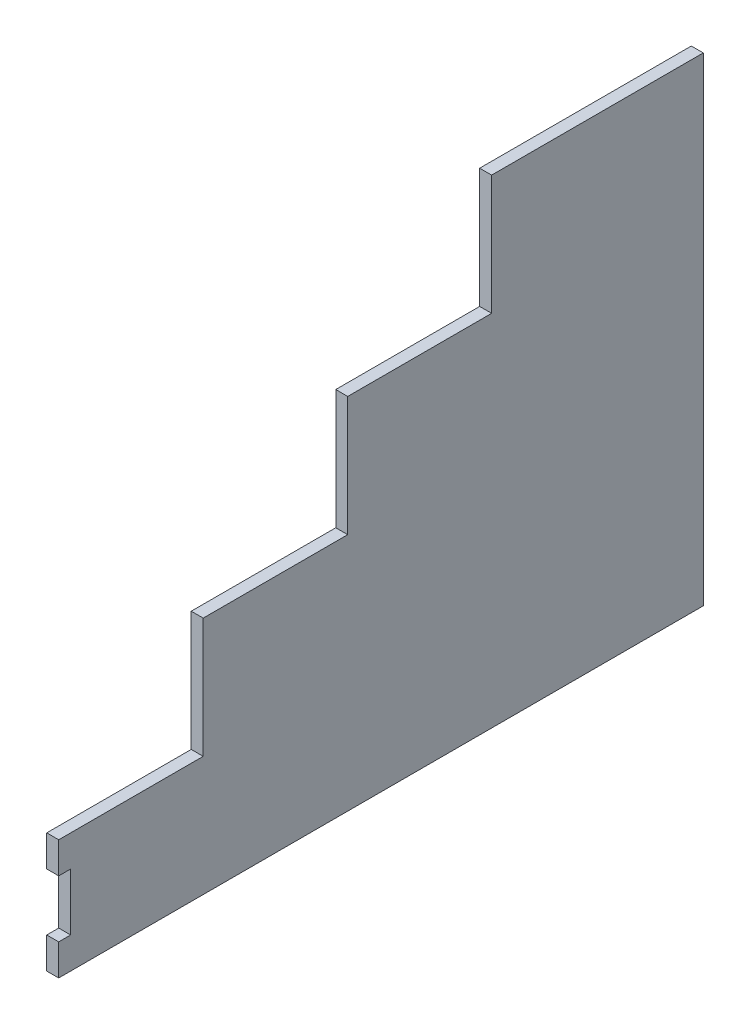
ISO-10303-21;
HEADER;
FILE_DESCRIPTION(('STEP AP214'),'2;1');
FILE_NAME('part.step','',(''),(''),'','','');
FILE_SCHEMA(('AUTOMOTIVE_DESIGN { 1 0 10303 214 1 1 1 1 }'));
ENDSEC;
DATA;
#1=APPLICATION_CONTEXT('core data for automotive mechanical design processes');
#2=APPLICATION_PROTOCOL_DEFINITION('international standard','automotive_design',2000,#1);
#3=PRODUCT_CONTEXT('',#1,'mechanical');
#4=PRODUCT('Part','Part','',(#3));
#5=PRODUCT_RELATED_PRODUCT_CATEGORY('part','',(#4));
#6=PRODUCT_DEFINITION_FORMATION('','',#4);
#7=PRODUCT_DEFINITION_CONTEXT('part definition',#1,'design');
#8=PRODUCT_DEFINITION('design','',#6,#7);
#9=PRODUCT_DEFINITION_SHAPE('','',#8);
#10=(LENGTH_UNIT() NAMED_UNIT(*) SI_UNIT(.MILLI.,.METRE.));
#11=(NAMED_UNIT(*) PLANE_ANGLE_UNIT() SI_UNIT($,.RADIAN.));
#12=(NAMED_UNIT(*) SI_UNIT($,.STERADIAN.) SOLID_ANGLE_UNIT());
#13=UNCERTAINTY_MEASURE_WITH_UNIT(LENGTH_MEASURE(1.E-05),#10,'distance_accuracy_value','');
#14=(GEOMETRIC_REPRESENTATION_CONTEXT(3) GLOBAL_UNCERTAINTY_ASSIGNED_CONTEXT((#13)) GLOBAL_UNIT_ASSIGNED_CONTEXT((#10,
#11,#12)) REPRESENTATION_CONTEXT('',''));
#15=CARTESIAN_POINT('',(0.,0.,0.));
#16=DIRECTION('',(0.,0.,1.));
#17=DIRECTION('',(1.,0.,0.));
#18=AXIS2_PLACEMENT_3D('',#15,#16,#17);
#19=CARTESIAN_POINT('',(6.35,0.,101.6));
#20=DIRECTION('',(0.,1.,0.));
#21=DIRECTION('',(0.,0.,1.));
#22=AXIS2_PLACEMENT_3D('',#19,#20,#21);
#23=PLANE('',#22);
#24=DIRECTION('',(0.,0.,-1.));
#25=VECTOR('',#24,1.);
#26=CARTESIAN_POINT('',(-6.35,0.,101.6));
#27=LINE('',#26,#25);
#28=CARTESIAN_POINT('',(-6.35,0.,785.375879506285));
#29=VERTEX_POINT('',#28);
#30=CARTESIAN_POINT('',(-6.35,0.,101.6));
#31=VERTEX_POINT('',#30);
#32=EDGE_CURVE('E162',#29,#31,#27,.T.);
#33=ORIENTED_EDGE('',*,*,#32,.T.);
#34=DIRECTION('',(-1.,0.,0.));
#35=VECTOR('',#34,1.);
#36=CARTESIAN_POINT('',(6.35,0.,101.6));
#37=LINE('',#36,#35);
#38=CARTESIAN_POINT('',(6.35,0.,101.6));
#39=VERTEX_POINT('',#38);
#40=EDGE_CURVE('E11',#39,#31,#37,.T.);
#41=ORIENTED_EDGE('',*,*,#40,.F.);
#42=DIRECTION('',(0.,0.,-1.));
#43=VECTOR('',#42,1.);
#44=CARTESIAN_POINT('',(6.35,0.,101.6));
#45=LINE('',#44,#43);
#46=CARTESIAN_POINT('',(6.35,0.,785.375879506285));
#47=VERTEX_POINT('',#46);
#48=EDGE_CURVE('E188',#47,#39,#45,.T.);
#49=ORIENTED_EDGE('',*,*,#48,.F.);
#50=DIRECTION('',(-1.,0.,0.));
#51=VECTOR('',#50,1.);
#52=CARTESIAN_POINT('',(6.35,0.,785.375879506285));
#53=LINE('',#52,#51);
#54=EDGE_CURVE('E158',#47,#29,#53,.T.);
#55=ORIENTED_EDGE('',*,*,#54,.T.);
#56=EDGE_LOOP('',(#33,#41,#49,#55));
#57=FACE_BOUND('',#56,.T.);
#58=ADVANCED_FACE('F30',(#57),#23,.F.);
#59=CARTESIAN_POINT('',(6.35,0.,101.6));
#60=DIRECTION('',(0.,0.,1.));
#61=DIRECTION('',(1.,0.,0.));
#62=AXIS2_PLACEMENT_3D('',#59,#60,#61);
#63=PLANE('',#62);
#64=DIRECTION('',(0.,1.,0.));
#65=VECTOR('',#64,1.);
#66=CARTESIAN_POINT('',(-6.35,0.,101.6));
#67=LINE('',#66,#65);
#68=CARTESIAN_POINT('',(-6.35,508.,101.6));
#69=VERTEX_POINT('',#68);
#70=EDGE_CURVE('E165',#31,#69,#67,.T.);
#71=ORIENTED_EDGE('',*,*,#70,.T.);
#72=DIRECTION('',(-1.,0.,0.));
#73=VECTOR('',#72,1.);
#74=CARTESIAN_POINT('',(6.35,508.,101.6));
#75=LINE('',#74,#73);
#76=CARTESIAN_POINT('',(6.35,508.,101.6));
#77=VERTEX_POINT('',#76);
#78=EDGE_CURVE('E38',#77,#69,#75,.T.);
#79=ORIENTED_EDGE('',*,*,#78,.F.);
#80=DIRECTION('',(0.,1.,0.));
#81=VECTOR('',#80,1.);
#82=CARTESIAN_POINT('',(6.35,0.,101.6));
#83=LINE('',#82,#81);
#84=EDGE_CURVE('E107',#39,#77,#83,.T.);
#85=ORIENTED_EDGE('',*,*,#84,.F.);
#86=ORIENTED_EDGE('',*,*,#40,.T.);
#87=EDGE_LOOP('',(#71,#79,#85,#86));
#88=FACE_BOUND('',#87,.T.);
#89=ADVANCED_FACE('F276',(#88),#63,.F.);
#90=CARTESIAN_POINT('',(6.35,508.,101.6));
#91=DIRECTION('',(0.,-1.,0.));
#92=DIRECTION('',(0.,0.,-1.));
#93=AXIS2_PLACEMENT_3D('',#90,#91,#92);
#94=PLANE('',#93);
#95=DIRECTION('',(0.,0.,1.));
#96=VECTOR('',#95,1.);
#97=CARTESIAN_POINT('',(-6.35,508.,101.6));
#98=LINE('',#97,#96);
#99=CARTESIAN_POINT('',(-6.35,508.,326.106403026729));
#100=VERTEX_POINT('',#99);
#101=EDGE_CURVE('E167',#69,#100,#98,.T.);
#102=ORIENTED_EDGE('',*,*,#101,.T.);
#103=DIRECTION('',(-1.,0.,0.));
#104=VECTOR('',#103,1.);
#105=CARTESIAN_POINT('',(6.35,508.,326.106403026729));
#106=LINE('',#105,#104);
#107=CARTESIAN_POINT('',(6.35,508.,326.106403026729));
#108=VERTEX_POINT('',#107);
#109=EDGE_CURVE('E213',#108,#100,#106,.T.);
#110=ORIENTED_EDGE('',*,*,#109,.F.);
#111=DIRECTION('',(0.,0.,1.));
#112=VECTOR('',#111,1.);
#113=CARTESIAN_POINT('',(6.35,508.,101.6));
#114=LINE('',#113,#112);
#115=EDGE_CURVE('E221',#77,#108,#114,.T.);
#116=ORIENTED_EDGE('',*,*,#115,.F.);
#117=ORIENTED_EDGE('',*,*,#78,.T.);
#118=EDGE_LOOP('',(#102,#110,#116,#117));
#119=FACE_BOUND('',#118,.T.);
#120=ADVANCED_FACE('F219',(#119),#94,.F.);
#121=CARTESIAN_POINT('',(6.35,508.,326.106403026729));
#122=DIRECTION('',(0.,0.,-1.));
#123=DIRECTION('',(0.,1.,0.));
#124=AXIS2_PLACEMENT_3D('',#121,#122,#123);
#125=PLANE('',#124);
#126=DIRECTION('',(0.,-1.,0.));
#127=VECTOR('',#126,1.);
#128=CARTESIAN_POINT('',(-6.35,508.,326.106403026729));
#129=LINE('',#128,#127);
#130=CARTESIAN_POINT('',(-6.35,381.,326.106403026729));
#131=VERTEX_POINT('',#130);
#132=EDGE_CURVE('E169',#100,#131,#129,.T.);
#133=ORIENTED_EDGE('',*,*,#132,.T.);
#134=DIRECTION('',(-1.,0.,0.));
#135=VECTOR('',#134,1.);
#136=CARTESIAN_POINT('',(6.35,381.,326.106403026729));
#137=LINE('',#136,#135);
#138=CARTESIAN_POINT('',(6.35,381.,326.106403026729));
#139=VERTEX_POINT('',#138);
#140=EDGE_CURVE('E210',#139,#131,#137,.T.);
#141=ORIENTED_EDGE('',*,*,#140,.F.);
#142=DIRECTION('',(0.,-1.,0.));
#143=VECTOR('',#142,1.);
#144=CARTESIAN_POINT('',(6.35,508.,326.106403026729));
#145=LINE('',#144,#143);
#146=EDGE_CURVE('E239',#108,#139,#145,.T.);
#147=ORIENTED_EDGE('',*,*,#146,.F.);
#148=ORIENTED_EDGE('',*,*,#109,.T.);
#149=EDGE_LOOP('',(#133,#141,#147,#148));
#150=FACE_BOUND('',#149,.T.);
#151=ADVANCED_FACE('F230',(#150),#125,.F.);
#152=CARTESIAN_POINT('',(6.35,381.,326.106403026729));
#153=DIRECTION('',(0.,-1.,0.));
#154=DIRECTION('',(0.,0.,-1.));
#155=AXIS2_PLACEMENT_3D('',#152,#153,#154);
#156=PLANE('',#155);
#157=DIRECTION('',(0.,0.,1.));
#158=VECTOR('',#157,1.);
#159=CARTESIAN_POINT('',(-6.35,381.,326.106403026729));
#160=LINE('',#159,#158);
#161=CARTESIAN_POINT('',(-6.35,381.,478.770757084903));
#162=VERTEX_POINT('',#161);
#163=EDGE_CURVE('E171',#131,#162,#160,.T.);
#164=ORIENTED_EDGE('',*,*,#163,.T.);
#165=DIRECTION('',(-1.,0.,0.));
#166=VECTOR('',#165,1.);
#167=CARTESIAN_POINT('',(6.35,381.,478.770757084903));
#168=LINE('',#167,#166);
#169=CARTESIAN_POINT('',(6.35,381.,478.770757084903));
#170=VERTEX_POINT('',#169);
#171=EDGE_CURVE('E207',#170,#162,#168,.T.);
#172=ORIENTED_EDGE('',*,*,#171,.F.);
#173=DIRECTION('',(0.,0.,1.));
#174=VECTOR('',#173,1.);
#175=CARTESIAN_POINT('',(6.35,381.,326.106403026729));
#176=LINE('',#175,#174);
#177=EDGE_CURVE('E236',#139,#170,#176,.T.);
#178=ORIENTED_EDGE('',*,*,#177,.F.);
#179=ORIENTED_EDGE('',*,*,#140,.T.);
#180=EDGE_LOOP('',(#164,#172,#178,#179));
#181=FACE_BOUND('',#180,.T.);
#182=ADVANCED_FACE('F234',(#181),#156,.F.);
#183=CARTESIAN_POINT('',(6.35,381.,478.770757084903));
#184=DIRECTION('',(0.,0.,-1.));
#185=DIRECTION('',(-1.,0.,0.));
#186=AXIS2_PLACEMENT_3D('',#183,#184,#185);
#187=PLANE('',#186);
#188=DIRECTION('',(0.,-1.,0.));
#189=VECTOR('',#188,1.);
#190=CARTESIAN_POINT('',(-6.35,381.,478.770757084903));
#191=LINE('',#190,#189);
#192=CARTESIAN_POINT('',(-6.35,254.,478.770757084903));
#193=VERTEX_POINT('',#192);
#194=EDGE_CURVE('E173',#162,#193,#191,.T.);
#195=ORIENTED_EDGE('',*,*,#194,.T.);
#196=DIRECTION('',(-1.,0.,0.));
#197=VECTOR('',#196,1.);
#198=CARTESIAN_POINT('',(6.35,254.,478.770757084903));
#199=LINE('',#198,#197);
#200=CARTESIAN_POINT('',(6.35,254.,478.770757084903));
#201=VERTEX_POINT('',#200);
#202=EDGE_CURVE('E204',#201,#193,#199,.T.);
#203=ORIENTED_EDGE('',*,*,#202,.F.);
#204=DIRECTION('',(0.,-1.,0.));
#205=VECTOR('',#204,1.);
#206=CARTESIAN_POINT('',(6.35,381.,478.770757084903));
#207=LINE('',#206,#205);
#208=EDGE_CURVE('E238',#170,#201,#207,.T.);
#209=ORIENTED_EDGE('',*,*,#208,.F.);
#210=ORIENTED_EDGE('',*,*,#171,.T.);
#211=EDGE_LOOP('',(#195,#203,#209,#210));
#212=FACE_BOUND('',#211,.T.);
#213=ADVANCED_FACE('F289',(#212),#187,.F.);
#214=CARTESIAN_POINT('',(6.35,254.,478.770757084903));
#215=DIRECTION('',(0.,-1.,0.));
#216=DIRECTION('',(0.,0.,-1.));
#217=AXIS2_PLACEMENT_3D('',#214,#215,#216);
#218=PLANE('',#217);
#219=DIRECTION('',(0.,0.,1.));
#220=VECTOR('',#219,1.);
#221=CARTESIAN_POINT('',(-6.35,254.,478.770757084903));
#222=LINE('',#221,#220);
#223=CARTESIAN_POINT('',(-6.35,254.,632.073318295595));
#224=VERTEX_POINT('',#223);
#225=EDGE_CURVE('E175',#193,#224,#222,.T.);
#226=ORIENTED_EDGE('',*,*,#225,.T.);
#227=DIRECTION('',(-1.,0.,0.));
#228=VECTOR('',#227,1.);
#229=CARTESIAN_POINT('',(6.35,254.,632.073318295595));
#230=LINE('',#229,#228);
#231=CARTESIAN_POINT('',(6.35,254.,632.073318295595));
#232=VERTEX_POINT('',#231);
#233=EDGE_CURVE('E201',#232,#224,#230,.T.);
#234=ORIENTED_EDGE('',*,*,#233,.F.);
#235=DIRECTION('',(0.,0.,1.));
#236=VECTOR('',#235,1.);
#237=CARTESIAN_POINT('',(6.35,254.,478.770757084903));
#238=LINE('',#237,#236);
#239=EDGE_CURVE('E241',#201,#232,#238,.T.);
#240=ORIENTED_EDGE('',*,*,#239,.F.);
#241=ORIENTED_EDGE('',*,*,#202,.T.);
#242=EDGE_LOOP('',(#226,#234,#240,#241));
#243=FACE_BOUND('',#242,.T.);
#244=ADVANCED_FACE('F292',(#243),#218,.F.);
#245=CARTESIAN_POINT('',(6.35,254.,632.073318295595));
#246=DIRECTION('',(0.,0.,-1.));
#247=DIRECTION('',(-1.,0.,0.));
#248=AXIS2_PLACEMENT_3D('',#245,#246,#247);
#249=PLANE('',#248);
#250=DIRECTION('',(0.,-1.,0.));
#251=VECTOR('',#250,1.);
#252=CARTESIAN_POINT('',(-6.35,254.,632.073318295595));
#253=LINE('',#252,#251);
#254=CARTESIAN_POINT('',(-6.35,127.,632.073318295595));
#255=VERTEX_POINT('',#254);
#256=EDGE_CURVE('E177',#224,#255,#253,.T.);
#257=ORIENTED_EDGE('',*,*,#256,.T.);
#258=DIRECTION('',(-1.,0.,0.));
#259=VECTOR('',#258,1.);
#260=CARTESIAN_POINT('',(6.35,127.,632.073318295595));
#261=LINE('',#260,#259);
#262=CARTESIAN_POINT('',(6.35,127.,632.073318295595));
#263=VERTEX_POINT('',#262);
#264=EDGE_CURVE('E198',#263,#255,#261,.T.);
#265=ORIENTED_EDGE('',*,*,#264,.F.);
#266=DIRECTION('',(0.,-1.,0.));
#267=VECTOR('',#266,1.);
#268=CARTESIAN_POINT('',(6.35,254.,632.073318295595));
#269=LINE('',#268,#267);
#270=EDGE_CURVE('E247',#232,#263,#269,.T.);
#271=ORIENTED_EDGE('',*,*,#270,.F.);
#272=ORIENTED_EDGE('',*,*,#233,.T.);
#273=EDGE_LOOP('',(#257,#265,#271,#272));
#274=FACE_BOUND('',#273,.T.);
#275=ADVANCED_FACE('F296',(#274),#249,.F.);
#276=CARTESIAN_POINT('',(6.35,127.,632.073318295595));
#277=DIRECTION('',(0.,-1.,0.));
#278=DIRECTION('',(0.,0.,-1.));
#279=AXIS2_PLACEMENT_3D('',#276,#277,#278);
#280=PLANE('',#279);
#281=DIRECTION('',(0.,0.,1.));
#282=VECTOR('',#281,1.);
#283=CARTESIAN_POINT('',(-6.35,127.,632.073318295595));
#284=LINE('',#283,#282);
#285=CARTESIAN_POINT('',(-6.35,127.,785.375879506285));
#286=VERTEX_POINT('',#285);
#287=EDGE_CURVE('E179',#255,#286,#284,.T.);
#288=ORIENTED_EDGE('',*,*,#287,.T.);
#289=DIRECTION('',(-1.,0.,0.));
#290=VECTOR('',#289,1.);
#291=CARTESIAN_POINT('',(6.35,127.,785.375879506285));
#292=LINE('',#291,#290);
#293=CARTESIAN_POINT('',(6.35,127.,785.375879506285));
#294=VERTEX_POINT('',#293);
#295=EDGE_CURVE('E195',#294,#286,#292,.T.);
#296=ORIENTED_EDGE('',*,*,#295,.F.);
#297=DIRECTION('',(0.,0.,1.));
#298=VECTOR('',#297,1.);
#299=CARTESIAN_POINT('',(6.35,127.,632.073318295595));
#300=LINE('',#299,#298);
#301=EDGE_CURVE('E249',#263,#294,#300,.T.);
#302=ORIENTED_EDGE('',*,*,#301,.F.);
#303=ORIENTED_EDGE('',*,*,#264,.T.);
#304=EDGE_LOOP('',(#288,#296,#302,#303));
#305=FACE_BOUND('',#304,.T.);
#306=ADVANCED_FACE('F300',(#305),#280,.F.);
#307=CARTESIAN_POINT('',(6.35,127.,785.375879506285));
#308=DIRECTION('',(0.,0.,-1.));
#309=DIRECTION('',(-1.,0.,0.));
#310=AXIS2_PLACEMENT_3D('',#307,#308,#309);
#311=PLANE('',#310);
#312=DIRECTION('',(0.,-1.,0.));
#313=VECTOR('',#312,1.);
#314=CARTESIAN_POINT('',(-6.35,127.,785.375879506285));
#315=LINE('',#314,#313);
#316=CARTESIAN_POINT('',(-6.35,93.8094552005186,785.375879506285));
#317=VERTEX_POINT('',#316);
#318=EDGE_CURVE('E181',#286,#317,#315,.T.);
#319=ORIENTED_EDGE('',*,*,#318,.T.);
#320=DIRECTION('',(-1.,0.,0.));
#321=VECTOR('',#320,1.);
#322=CARTESIAN_POINT('',(6.35,93.8094552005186,785.375879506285));
#323=LINE('',#322,#321);
#324=CARTESIAN_POINT('',(6.35,93.8094552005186,785.375879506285));
#325=VERTEX_POINT('',#324);
#326=EDGE_CURVE('E192',#325,#317,#323,.T.);
#327=ORIENTED_EDGE('',*,*,#326,.F.);
#328=DIRECTION('',(0.,-1.,0.));
#329=VECTOR('',#328,1.);
#330=CARTESIAN_POINT('',(6.35,127.,785.375879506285));
#331=LINE('',#330,#329);
#332=EDGE_CURVE('E251',#294,#325,#331,.T.);
#333=ORIENTED_EDGE('',*,*,#332,.F.);
#334=ORIENTED_EDGE('',*,*,#295,.T.);
#335=EDGE_LOOP('',(#319,#327,#333,#334));
#336=FACE_BOUND('',#335,.T.);
#337=ADVANCED_FACE('F257',(#336),#311,.F.);
#338=CARTESIAN_POINT('',(6.35,93.8094552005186,785.375879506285));
#339=DIRECTION('',(0.,1.,0.));
#340=DIRECTION('',(0.,0.,1.));
#341=AXIS2_PLACEMENT_3D('',#338,#339,#340);
#342=PLANE('',#341);
#343=DIRECTION('',(0.,0.,-1.));
#344=VECTOR('',#343,1.);
#345=CARTESIAN_POINT('',(-6.35,93.8094552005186,785.375879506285));
#346=LINE('',#345,#344);
#347=CARTESIAN_POINT('',(-6.35,93.8094552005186,772.675879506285));
#348=VERTEX_POINT('',#347);
#349=EDGE_CURVE('E183',#317,#348,#346,.T.);
#350=ORIENTED_EDGE('',*,*,#349,.T.);
#351=DIRECTION('',(-1.,0.,0.));
#352=VECTOR('',#351,1.);
#353=CARTESIAN_POINT('',(6.35,93.8094552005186,772.675879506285));
#354=LINE('',#353,#352);
#355=CARTESIAN_POINT('',(6.35,93.8094552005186,772.675879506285));
#356=VERTEX_POINT('',#355);
#357=EDGE_CURVE('E153',#356,#348,#354,.T.);
#358=ORIENTED_EDGE('',*,*,#357,.F.);
#359=DIRECTION('',(0.,0.,-1.));
#360=VECTOR('',#359,1.);
#361=CARTESIAN_POINT('',(6.35,93.8094552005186,785.375879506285));
#362=LINE('',#361,#360);
#363=EDGE_CURVE('E144',#325,#356,#362,.T.);
#364=ORIENTED_EDGE('',*,*,#363,.F.);
#365=ORIENTED_EDGE('',*,*,#326,.T.);
#366=EDGE_LOOP('',(#350,#358,#364,#365));
#367=FACE_BOUND('',#366,.T.);
#368=ADVANCED_FACE('F261',(#367),#342,.F.);
#369=CARTESIAN_POINT('',(6.35,93.8094552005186,772.675879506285));
#370=DIRECTION('',(0.,0.,-1.));
#371=DIRECTION('',(-1.,0.,0.));
#372=AXIS2_PLACEMENT_3D('',#369,#370,#371);
#373=PLANE('',#372);
#374=DIRECTION('',(0.,-1.,0.));
#375=VECTOR('',#374,1.);
#376=CARTESIAN_POINT('',(-6.35,93.8094552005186,772.675879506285));
#377=LINE('',#376,#375);
#378=CARTESIAN_POINT('',(-6.35,33.1905447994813,772.675879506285));
#379=VERTEX_POINT('',#378);
#380=EDGE_CURVE('E152',#348,#379,#377,.T.);
#381=ORIENTED_EDGE('',*,*,#380,.T.);
#382=DIRECTION('',(-1.,0.,0.));
#383=VECTOR('',#382,1.);
#384=CARTESIAN_POINT('',(6.35,33.1905447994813,772.675879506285));
#385=LINE('',#384,#383);
#386=CARTESIAN_POINT('',(6.35,33.1905447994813,772.675879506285));
#387=VERTEX_POINT('',#386);
#388=EDGE_CURVE('E149',#387,#379,#385,.T.);
#389=ORIENTED_EDGE('',*,*,#388,.F.);
#390=DIRECTION('',(0.,-1.,0.));
#391=VECTOR('',#390,1.);
#392=CARTESIAN_POINT('',(6.35,93.8094552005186,772.675879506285));
#393=LINE('',#392,#391);
#394=EDGE_CURVE('E138',#356,#387,#393,.T.);
#395=ORIENTED_EDGE('',*,*,#394,.F.);
#396=ORIENTED_EDGE('',*,*,#357,.T.);
#397=EDGE_LOOP('',(#381,#389,#395,#396));
#398=FACE_BOUND('',#397,.T.);
#399=ADVANCED_FACE('F150',(#398),#373,.F.);
#400=CARTESIAN_POINT('',(6.35,33.1905447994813,772.675879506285));
#401=DIRECTION('',(0.,-1.,0.));
#402=DIRECTION('',(0.,0.,-1.));
#403=AXIS2_PLACEMENT_3D('',#400,#401,#402);
#404=PLANE('',#403);
#405=DIRECTION('',(0.,0.,1.));
#406=VECTOR('',#405,1.);
#407=CARTESIAN_POINT('',(-6.35,33.1905447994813,772.675879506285));
#408=LINE('',#407,#406);
#409=CARTESIAN_POINT('',(-6.35,33.1905447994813,785.375879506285));
#410=VERTEX_POINT('',#409);
#411=EDGE_CURVE('E93',#379,#410,#408,.T.);
#412=ORIENTED_EDGE('',*,*,#411,.T.);
#413=DIRECTION('',(-1.,0.,0.));
#414=VECTOR('',#413,1.);
#415=CARTESIAN_POINT('',(6.35,33.1905447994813,785.375879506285));
#416=LINE('',#415,#414);
#417=CARTESIAN_POINT('',(6.35,33.1905447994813,785.375879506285));
#418=VERTEX_POINT('',#417);
#419=EDGE_CURVE('E154',#418,#410,#416,.T.);
#420=ORIENTED_EDGE('',*,*,#419,.F.);
#421=DIRECTION('',(0.,0.,1.));
#422=VECTOR('',#421,1.);
#423=CARTESIAN_POINT('',(6.35,33.1905447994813,772.675879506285));
#424=LINE('',#423,#422);
#425=EDGE_CURVE('E142',#387,#418,#424,.T.);
#426=ORIENTED_EDGE('',*,*,#425,.F.);
#427=ORIENTED_EDGE('',*,*,#388,.T.);
#428=EDGE_LOOP('',(#412,#420,#426,#427));
#429=FACE_BOUND('',#428,.T.);
#430=ADVANCED_FACE('F156',(#429),#404,.F.);
#431=CARTESIAN_POINT('',(6.35,33.1905447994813,785.375879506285));
#432=DIRECTION('',(0.,0.,-1.));
#433=DIRECTION('',(0.,1.,0.));
#434=AXIS2_PLACEMENT_3D('',#431,#432,#433);
#435=PLANE('',#434);
#436=DIRECTION('',(0.,-1.,0.));
#437=VECTOR('',#436,1.);
#438=CARTESIAN_POINT('',(-6.35,33.1905447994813,785.375879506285));
#439=LINE('',#438,#437);
#440=EDGE_CURVE('E99',#410,#29,#439,.T.);
#441=ORIENTED_EDGE('',*,*,#440,.T.);
#442=ORIENTED_EDGE('',*,*,#54,.F.);
#443=DIRECTION('',(0.,-1.,0.));
#444=VECTOR('',#443,1.);
#445=CARTESIAN_POINT('',(6.35,33.1905447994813,785.375879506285));
#446=LINE('',#445,#444);
#447=EDGE_CURVE('E46',#418,#47,#446,.T.);
#448=ORIENTED_EDGE('',*,*,#447,.F.);
#449=ORIENTED_EDGE('',*,*,#419,.T.);
#450=EDGE_LOOP('',(#441,#442,#448,#449));
#451=FACE_BOUND('',#450,.T.);
#452=ADVANCED_FACE('F265',(#451),#435,.F.);
#453=CARTESIAN_POINT('',(6.35,0.,772.675879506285));
#454=DIRECTION('',(1.,0.,0.));
#455=DIRECTION('',(0.,0.,-1.));
#456=AXIS2_PLACEMENT_3D('',#453,#454,#455);
#457=PLANE('',#456);
#458=ORIENTED_EDGE('',*,*,#48,.T.);
#459=ORIENTED_EDGE('',*,*,#84,.T.);
#460=ORIENTED_EDGE('',*,*,#115,.T.);
#461=ORIENTED_EDGE('',*,*,#146,.T.);
#462=ORIENTED_EDGE('',*,*,#177,.T.);
#463=ORIENTED_EDGE('',*,*,#208,.T.);
#464=ORIENTED_EDGE('',*,*,#239,.T.);
#465=ORIENTED_EDGE('',*,*,#270,.T.);
#466=ORIENTED_EDGE('',*,*,#301,.T.);
#467=ORIENTED_EDGE('',*,*,#332,.T.);
#468=ORIENTED_EDGE('',*,*,#363,.T.);
#469=ORIENTED_EDGE('',*,*,#394,.T.);
#470=ORIENTED_EDGE('',*,*,#425,.T.);
#471=ORIENTED_EDGE('',*,*,#447,.T.);
#472=EDGE_LOOP('',(#458,#459,#460,#461,#462,#463,#464,#465,#466,#467,#468,#469,#470,#471));
#473=FACE_BOUND('',#472,.T.);
#474=ADVANCED_FACE('F140',(#473),#457,.T.);
#475=CARTESIAN_POINT('',(-6.35,0.,772.675879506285));
#476=DIRECTION('',(1.,0.,0.));
#477=DIRECTION('',(0.,0.,-1.));
#478=AXIS2_PLACEMENT_3D('',#475,#476,#477);
#479=PLANE('',#478);
#480=ORIENTED_EDGE('',*,*,#32,.F.);
#481=ORIENTED_EDGE('',*,*,#440,.F.);
#482=ORIENTED_EDGE('',*,*,#411,.F.);
#483=ORIENTED_EDGE('',*,*,#380,.F.);
#484=ORIENTED_EDGE('',*,*,#349,.F.);
#485=ORIENTED_EDGE('',*,*,#318,.F.);
#486=ORIENTED_EDGE('',*,*,#287,.F.);
#487=ORIENTED_EDGE('',*,*,#256,.F.);
#488=ORIENTED_EDGE('',*,*,#225,.F.);
#489=ORIENTED_EDGE('',*,*,#194,.F.);
#490=ORIENTED_EDGE('',*,*,#163,.F.);
#491=ORIENTED_EDGE('',*,*,#132,.F.);
#492=ORIENTED_EDGE('',*,*,#101,.F.);
#493=ORIENTED_EDGE('',*,*,#70,.F.);
#494=EDGE_LOOP('',(#480,#481,#482,#483,#484,#485,#486,#487,#488,#489,#490,#491,#492,#493));
#495=FACE_BOUND('',#494,.T.);
#496=ADVANCED_FACE('F225',(#495),#479,.F.);
#497=CLOSED_SHELL('',(#58,#89,#120,#151,#182,#213,#244,#275,#306,#337,#368,#399,#430,#452,#474,#496));
#498=MANIFOLD_SOLID_BREP('B2',#497);
#499=ADVANCED_BREP_SHAPE_REPRESENTATION('',(#18,#498),#14);
#500=SHAPE_DEFINITION_REPRESENTATION(#9,#499);
ENDSEC;
END-ISO-10303-21;
